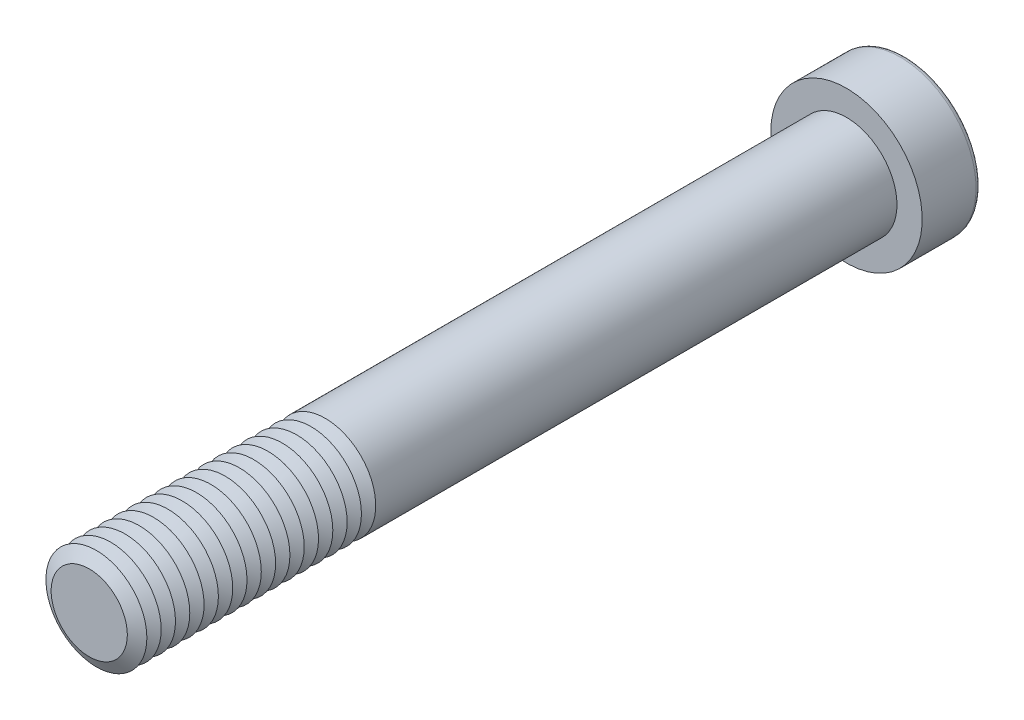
from build123d import *

# Parameters (mm, degrees)
SKETCH1_R           = 6
BOSS_EXTRUDE1_DEPTH = 90
SKETCH2_R           = 9
BOSS_EXTRUDE2_DEPTH = 7
CUT_EXTRUDE1_DEPTH  = 6
FILLET1_R           = 0.6
LPATTERN1_COUNT     = 17
LPATTERN1_PITCH     = 1.7


with BuildPart() as part:
    # Sketch1 → Boss-Extrude1 (new body)
    with BuildSketch(Plane.XY):
        with Locations(Location((0, 0, 0), (0, 0, 180))):
            Circle(SKETCH1_R)
    extrude(amount=BOSS_EXTRUDE1_DEPTH)

    # Sketch2 → Boss-Extrude2 (add)
    with BuildSketch(Plane(origin=(0, 0, 0), x_dir=(-1, 0, 0), z_dir=(0, 0, -1))):
        Circle(SKETCH2_R)
    extrude(amount=BOSS_EXTRUDE2_DEPTH)

    # Sketch3 → Cut-Extrude1 (cut)
    with BuildSketch(Plane(origin=(0, 0, -7), x_dir=(-1, 0, 0), z_dir=(0, 0, -1))):
        Polygon((-2.309401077, 4), (-4.618802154, 0), (-2.309401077, -4), (2.309401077, -4), (4.618802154, 0), (2.309401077, 4), align=None)
    extrude(amount=-CUT_EXTRUDE1_DEPTH, mode=Mode.SUBTRACT)

    # Fillet1
    fillet1_edges = [part.edges().sort_by_distance(p)[0] for p in [
        (9, 0, -7),
    ]]
    fillet(fillet1_edges, radius=FILLET1_R)

    # Cut-Extrude2 cone 1 section (on through the dimple's axis) → Cut-Extrude2 (revolve, cut)
    with BuildSketch(Plane(origin=(0, 0, -1), x_dir=(0, 1, 0), z_dir=(1, 0, 0))):
        Polygon((0, 0), (4, 0), (0, 2.309401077), align=None)
    revolve(axis=Axis((0, 0, -1), (0, 0, 1)), mode=Mode.SUBTRACT)

    # Cut-Extrude3 cone 1 section (on through the dimple's axis) → Cut-Extrude3 (revolve, cut)
    with BuildSketch(Plane(origin=(0, 0, -7), x_dir=(0, 1, 0), z_dir=(1, 0, 0))):
        Polygon((0, 0), (4.618802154, 0), (0, 1.237604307), align=None)
    revolve(axis=Axis((0, 0, -7), (0, 0, 1)), mode=Mode.SUBTRACT)

    # Sketch7 → Cut-Revolve1 (revolve, cut)
    with BuildSketch(Plane(origin=(0, 0, 0), x_dir=(0, 0, -1), z_dir=(1, 0, 0)), mode=Mode.PRIVATE) as cut_revolve1_sk:
        Polygon((-90, 4.527756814), (-89.15, 6), (-90.85, 6), align=None)
    cut_revolve1 = revolve(cut_revolve1_sk.sketch.rotate(Axis((0, 0, 90), (0, 0, -1)), 270), axis=Axis((0, 0, 90), (0, 0, -1)), mode=Mode.SUBTRACT)

    # LPattern1: Cut-Revolve1 ×17
    with Locations(*[(0, 0, -i * LPATTERN1_PITCH) for i in range(1, LPATTERN1_COUNT)]):
        add(cut_revolve1, mode=Mode.SUBTRACT)


solid = part.part
